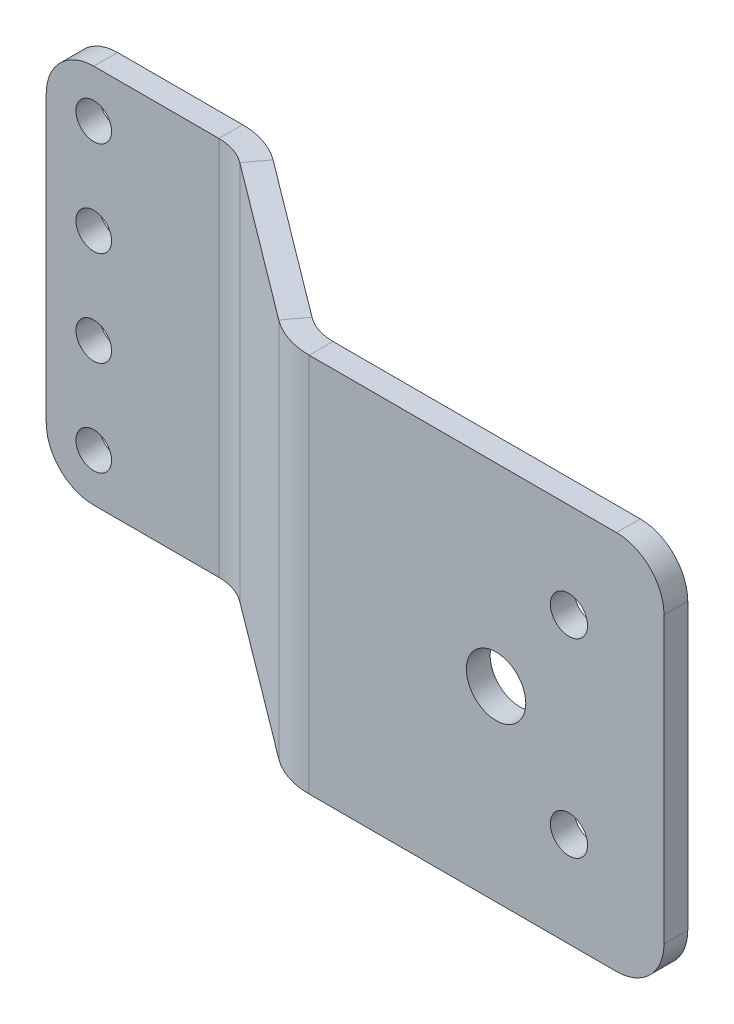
ISO-10303-21;
HEADER;
FILE_DESCRIPTION(('STEP AP214'),'2;1');
FILE_NAME('part.step','',(''),(''),'','','');
FILE_SCHEMA(('AUTOMOTIVE_DESIGN { 1 0 10303 214 1 1 1 1 }'));
ENDSEC;
DATA;
#1=APPLICATION_CONTEXT('core data for automotive mechanical design processes');
#2=APPLICATION_PROTOCOL_DEFINITION('international standard','automotive_design',2000,#1);
#3=PRODUCT_CONTEXT('',#1,'mechanical');
#4=PRODUCT('Part','Part','',(#3));
#5=PRODUCT_RELATED_PRODUCT_CATEGORY('part','',(#4));
#6=PRODUCT_DEFINITION_FORMATION('','',#4);
#7=PRODUCT_DEFINITION_CONTEXT('part definition',#1,'design');
#8=PRODUCT_DEFINITION('design','',#6,#7);
#9=PRODUCT_DEFINITION_SHAPE('','',#8);
#10=(LENGTH_UNIT() NAMED_UNIT(*) SI_UNIT(.MILLI.,.METRE.));
#11=(NAMED_UNIT(*) PLANE_ANGLE_UNIT() SI_UNIT($,.RADIAN.));
#12=(NAMED_UNIT(*) SI_UNIT($,.STERADIAN.) SOLID_ANGLE_UNIT());
#13=UNCERTAINTY_MEASURE_WITH_UNIT(LENGTH_MEASURE(1.E-05),#10,'distance_accuracy_value','');
#14=(GEOMETRIC_REPRESENTATION_CONTEXT(3) GLOBAL_UNCERTAINTY_ASSIGNED_CONTEXT((#13)) GLOBAL_UNIT_ASSIGNED_CONTEXT((#10,
#11,#12)) REPRESENTATION_CONTEXT('',''));
#15=CARTESIAN_POINT('',(0.,0.,0.));
#16=DIRECTION('',(0.,0.,1.));
#17=DIRECTION('',(1.,0.,0.));
#18=AXIS2_PLACEMENT_3D('',#15,#16,#17);
#19=CARTESIAN_POINT('',(-28.1133333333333,50.8,17.015));
#20=DIRECTION('',(0.,1.,0.));
#21=DIRECTION('',(0.,0.,1.));
#22=AXIS2_PLACEMENT_3D('',#19,#20,#21);
#23=PLANE('',#22);
#24=DIRECTION('',(0.6,0.,-0.8));
#25=VECTOR('',#24,1.);
#26=CARTESIAN_POINT('',(-28.1133333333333,50.8,17.015));
#27=LINE('',#26,#25);
#28=CARTESIAN_POINT('',(-28.1133333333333,50.8,17.015));
#29=VERTEX_POINT('',#28);
#30=CARTESIAN_POINT('',(-26.2083333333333,50.8,14.475));
#31=VERTEX_POINT('',#30);
#32=EDGE_CURVE('E271',#29,#31,#27,.T.);
#33=ORIENTED_EDGE('',*,*,#32,.F.);
#34=CARTESIAN_POINT('',(-22.0083333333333,50.8,8.875));
#35=DIRECTION('',(0.,1.,0.));
#36=DIRECTION('',(0.,0.,1.));
#37=AXIS2_PLACEMENT_3D('',#34,#35,#36);
#38=CIRCLE('',#37,10.175);
#39=CARTESIAN_POINT('',(-22.0083333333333,50.8,19.05));
#40=VERTEX_POINT('',#39);
#41=EDGE_CURVE('E188',#40,#29,#38,.F.);
#42=ORIENTED_EDGE('',*,*,#41,.F.);
#43=DIRECTION('',(0.,0.,1.));
#44=VECTOR('',#43,1.);
#45=CARTESIAN_POINT('',(-22.0083333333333,50.8,15.875));
#46=LINE('',#45,#44);
#47=CARTESIAN_POINT('',(-22.0083333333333,50.8,15.875));
#48=VERTEX_POINT('',#47);
#49=EDGE_CURVE('E268',#48,#40,#46,.T.);
#50=ORIENTED_EDGE('',*,*,#49,.F.);
#51=CARTESIAN_POINT('',(-22.0083333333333,50.8,8.875));
#52=DIRECTION('',(0.,1.,0.));
#53=DIRECTION('',(1.,0.,0.));
#54=AXIS2_PLACEMENT_3D('',#51,#52,#53);
#55=CIRCLE('',#54,7.);
#56=EDGE_CURVE('E198',#48,#31,#55,.F.);
#57=ORIENTED_EDGE('',*,*,#56,.T.);
#58=EDGE_LOOP('',(#33,#42,#50,#57));
#59=FACE_BOUND('',#58,.T.);
#60=ADVANCED_FACE('F38',(#59),#23,.T.);
#61=CARTESIAN_POINT('',(-22.0083333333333,50.8,15.875));
#62=DIRECTION('',(0.,1.,0.));
#63=DIRECTION('',(0.,0.,1.));
#64=AXIS2_PLACEMENT_3D('',#61,#62,#63);
#65=PLANE('',#64);
#66=DIRECTION('',(-0.8,0.,-0.6));
#67=VECTOR('',#66,1.);
#68=CARTESIAN_POINT('',(-25.4,50.8,19.05));
#69=LINE('',#68,#67);
#70=CARTESIAN_POINT('',(-48.9333333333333,50.8,1.39999999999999));
#71=VERTEX_POINT('',#70);
#72=EDGE_CURVE('E186',#29,#71,#69,.T.);
#73=ORIENTED_EDGE('',*,*,#72,.F.);
#74=ORIENTED_EDGE('',*,*,#32,.T.);
#75=DIRECTION('',(-0.8,0.,-0.6));
#76=VECTOR('',#75,1.);
#77=CARTESIAN_POINT('',(-23.495,50.8,16.51));
#78=LINE('',#77,#76);
#79=CARTESIAN_POINT('',(-47.0283333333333,50.8,-1.14000000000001));
#80=VERTEX_POINT('',#79);
#81=EDGE_CURVE('E201',#31,#80,#78,.T.);
#82=ORIENTED_EDGE('',*,*,#81,.T.);
#83=DIRECTION('',(-0.6,0.,0.8));
#84=VECTOR('',#83,1.);
#85=CARTESIAN_POINT('',(-47.0283333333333,50.8,-1.14000000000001));
#86=LINE('',#85,#84);
#87=EDGE_CURVE('E163',#80,#71,#86,.T.);
#88=ORIENTED_EDGE('',*,*,#87,.T.);
#89=EDGE_LOOP('',(#73,#74,#82,#88));
#90=FACE_BOUND('',#89,.T.);
#91=ADVANCED_FACE('F413',(#90),#65,.T.);
#92=CARTESIAN_POINT('',(-22.0083333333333,0.,19.05));
#93=DIRECTION('',(0.,-1.,0.));
#94=DIRECTION('',(0.,0.,-1.));
#95=AXIS2_PLACEMENT_3D('',#92,#93,#94);
#96=PLANE('',#95);
#97=DIRECTION('',(0.,0.,-1.));
#98=VECTOR('',#97,1.);
#99=CARTESIAN_POINT('',(-22.0083333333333,0.,19.05));
#100=LINE('',#99,#98);
#101=CARTESIAN_POINT('',(-22.0083333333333,0.,19.05));
#102=VERTEX_POINT('',#101);
#103=CARTESIAN_POINT('',(-22.0083333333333,0.,15.875));
#104=VERTEX_POINT('',#103);
#105=EDGE_CURVE('E265',#102,#104,#100,.T.);
#106=ORIENTED_EDGE('',*,*,#105,.F.);
#107=CARTESIAN_POINT('',(-22.0083333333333,0.,8.875));
#108=DIRECTION('',(0.,1.,0.));
#109=DIRECTION('',(0.,0.,1.));
#110=AXIS2_PLACEMENT_3D('',#107,#108,#109);
#111=CIRCLE('',#110,10.175);
#112=CARTESIAN_POINT('',(-28.1133333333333,0.,17.015));
#113=VERTEX_POINT('',#112);
#114=EDGE_CURVE('E216',#102,#113,#111,.F.);
#115=ORIENTED_EDGE('',*,*,#114,.T.);
#116=DIRECTION('',(-0.6,0.,0.8));
#117=VECTOR('',#116,1.);
#118=CARTESIAN_POINT('',(-26.2083333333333,0.,14.475));
#119=LINE('',#118,#117);
#120=CARTESIAN_POINT('',(-26.2083333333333,0.,14.475));
#121=VERTEX_POINT('',#120);
#122=EDGE_CURVE('E162',#121,#113,#119,.T.);
#123=ORIENTED_EDGE('',*,*,#122,.F.);
#124=CARTESIAN_POINT('',(-22.0083333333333,0.,8.875));
#125=DIRECTION('',(0.,1.,0.));
#126=DIRECTION('',(1.,0.,0.));
#127=AXIS2_PLACEMENT_3D('',#124,#125,#126);
#128=CIRCLE('',#127,7.);
#129=EDGE_CURVE('E223',#104,#121,#128,.F.);
#130=ORIENTED_EDGE('',*,*,#129,.F.);
#131=EDGE_LOOP('',(#106,#115,#123,#130));
#132=FACE_BOUND('',#131,.T.);
#133=ADVANCED_FACE('F391',(#132),#96,.T.);
#134=CARTESIAN_POINT('',(-26.2083333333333,0.,14.475));
#135=DIRECTION('',(0.,-1.,0.));
#136=DIRECTION('',(0.,0.,-1.));
#137=AXIS2_PLACEMENT_3D('',#134,#135,#136);
#138=PLANE('',#137);
#139=DIRECTION('',(-1.,0.,0.));
#140=VECTOR('',#139,1.);
#141=CARTESIAN_POINT('',(25.4,0.,15.875));
#142=LINE('',#141,#140);
#143=CARTESIAN_POINT('',(19.05,0.,15.875));
#144=VERTEX_POINT('',#143);
#145=EDGE_CURVE('E221',#144,#104,#142,.T.);
#146=ORIENTED_EDGE('',*,*,#145,.F.);
#147=DIRECTION('',(0.,0.,1.));
#148=VECTOR('',#147,1.);
#149=CARTESIAN_POINT('',(19.05,0.,14.475));
#150=LINE('',#149,#148);
#151=CARTESIAN_POINT('',(19.05,0.,19.05));
#152=VERTEX_POINT('',#151);
#153=EDGE_CURVE('E273',#144,#152,#150,.T.);
#154=ORIENTED_EDGE('',*,*,#153,.T.);
#155=DIRECTION('',(-1.,0.,0.));
#156=VECTOR('',#155,1.);
#157=CARTESIAN_POINT('',(25.4,0.,19.05));
#158=LINE('',#157,#156);
#159=EDGE_CURVE('E219',#152,#102,#158,.T.);
#160=ORIENTED_EDGE('',*,*,#159,.T.);
#161=ORIENTED_EDGE('',*,*,#105,.T.);
#162=EDGE_LOOP('',(#146,#154,#160,#161));
#163=FACE_BOUND('',#162,.T.);
#164=ADVANCED_FACE('F387',(#163),#138,.T.);
#165=CARTESIAN_POINT('',(-53.1333333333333,50.8,0.));
#166=DIRECTION('',(0.,1.,0.));
#167=DIRECTION('',(0.,0.,1.));
#168=AXIS2_PLACEMENT_3D('',#165,#166,#167);
#169=PLANE('',#168);
#170=DIRECTION('',(0.,0.,-1.));
#171=VECTOR('',#170,1.);
#172=CARTESIAN_POINT('',(-53.1333333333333,50.8,0.));
#173=LINE('',#172,#171);
#174=CARTESIAN_POINT('',(-53.1333333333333,50.8,0.));
#175=VERTEX_POINT('',#174);
#176=CARTESIAN_POINT('',(-53.1333333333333,50.8,-3.17500000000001));
#177=VERTEX_POINT('',#176);
#178=EDGE_CURVE('E153',#175,#177,#173,.T.);
#179=ORIENTED_EDGE('',*,*,#178,.F.);
#180=CARTESIAN_POINT('',(-53.1333333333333,50.8,6.99999999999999));
#181=DIRECTION('',(0.,-1.,0.));
#182=DIRECTION('',(0.,0.,-1.));
#183=AXIS2_PLACEMENT_3D('',#180,#181,#182);
#184=CIRCLE('',#183,7.);
#185=EDGE_CURVE('E157',#71,#175,#184,.F.);
#186=ORIENTED_EDGE('',*,*,#185,.F.);
#187=ORIENTED_EDGE('',*,*,#87,.F.);
#188=CARTESIAN_POINT('',(-53.1333333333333,50.8,6.99999999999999));
#189=DIRECTION('',(0.,1.,0.));
#190=DIRECTION('',(1.,0.,0.));
#191=AXIS2_PLACEMENT_3D('',#188,#189,#190);
#192=CIRCLE('',#191,10.175);
#193=EDGE_CURVE('E160',#80,#177,#192,.T.);
#194=ORIENTED_EDGE('',*,*,#193,.T.);
#195=EDGE_LOOP('',(#179,#186,#187,#194));
#196=FACE_BOUND('',#195,.T.);
#197=ADVANCED_FACE('F155',(#196),#169,.T.);
#198=CARTESIAN_POINT('',(-47.0283333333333,50.8,-1.14000000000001));
#199=DIRECTION('',(0.,1.,0.));
#200=DIRECTION('',(0.,0.,1.));
#201=AXIS2_PLACEMENT_3D('',#198,#199,#200);
#202=PLANE('',#201);
#203=DIRECTION('',(-1.,0.,0.));
#204=VECTOR('',#203,1.);
#205=CARTESIAN_POINT('',(-50.8,50.8,-3.17500000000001));
#206=LINE('',#205,#204);
#207=CARTESIAN_POINT('',(-69.85,50.8,-3.175));
#208=VERTEX_POINT('',#207);
#209=EDGE_CURVE('E181',#177,#208,#206,.T.);
#210=ORIENTED_EDGE('',*,*,#209,.T.);
#211=DIRECTION('',(0.,0.,-1.));
#212=VECTOR('',#211,1.);
#213=CARTESIAN_POINT('',(-69.85,50.8,-1.14000000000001));
#214=LINE('',#213,#212);
#215=CARTESIAN_POINT('',(-69.85,50.8,0.));
#216=VERTEX_POINT('',#215);
#217=EDGE_CURVE('E11',#208,#216,#214,.F.);
#218=ORIENTED_EDGE('',*,*,#217,.T.);
#219=DIRECTION('',(-1.,0.,0.));
#220=VECTOR('',#219,1.);
#221=CARTESIAN_POINT('',(-50.8,50.8,0.));
#222=LINE('',#221,#220);
#223=EDGE_CURVE('E170',#175,#216,#222,.T.);
#224=ORIENTED_EDGE('',*,*,#223,.F.);
#225=ORIENTED_EDGE('',*,*,#178,.T.);
#226=EDGE_LOOP('',(#210,#218,#224,#225));
#227=FACE_BOUND('',#226,.T.);
#228=ADVANCED_FACE('F180',(#227),#202,.T.);
#229=CARTESIAN_POINT('',(-48.9333333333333,0.,1.39999999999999));
#230=DIRECTION('',(0.,-1.,0.));
#231=DIRECTION('',(0.,0.,-1.));
#232=AXIS2_PLACEMENT_3D('',#229,#230,#231);
#233=PLANE('',#232);
#234=DIRECTION('',(0.6,0.,-0.8));
#235=VECTOR('',#234,1.);
#236=CARTESIAN_POINT('',(-48.9333333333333,0.,1.39999999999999));
#237=LINE('',#236,#235);
#238=CARTESIAN_POINT('',(-48.9333333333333,0.,1.39999999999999));
#239=VERTEX_POINT('',#238);
#240=CARTESIAN_POINT('',(-47.0283333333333,0.,-1.14000000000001));
#241=VERTEX_POINT('',#240);
#242=EDGE_CURVE('E261',#239,#241,#237,.T.);
#243=ORIENTED_EDGE('',*,*,#242,.F.);
#244=CARTESIAN_POINT('',(-53.1333333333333,0.,6.99999999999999));
#245=DIRECTION('',(0.,-1.,0.));
#246=DIRECTION('',(0.,0.,-1.));
#247=AXIS2_PLACEMENT_3D('',#244,#245,#246);
#248=CIRCLE('',#247,7.);
#249=CARTESIAN_POINT('',(-53.1333333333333,0.,0.));
#250=VERTEX_POINT('',#249);
#251=EDGE_CURVE('E211',#239,#250,#248,.F.);
#252=ORIENTED_EDGE('',*,*,#251,.T.);
#253=DIRECTION('',(0.,0.,1.));
#254=VECTOR('',#253,1.);
#255=CARTESIAN_POINT('',(-53.1333333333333,0.,-3.17500000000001));
#256=LINE('',#255,#254);
#257=CARTESIAN_POINT('',(-53.1333333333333,0.,-3.17500000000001));
#258=VERTEX_POINT('',#257);
#259=EDGE_CURVE('E259',#258,#250,#256,.T.);
#260=ORIENTED_EDGE('',*,*,#259,.F.);
#261=CARTESIAN_POINT('',(-53.1333333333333,0.,6.99999999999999));
#262=DIRECTION('',(0.,1.,0.));
#263=DIRECTION('',(1.,0.,0.));
#264=AXIS2_PLACEMENT_3D('',#261,#262,#263);
#265=CIRCLE('',#264,10.175);
#266=EDGE_CURVE('E229',#241,#258,#265,.T.);
#267=ORIENTED_EDGE('',*,*,#266,.F.);
#268=EDGE_LOOP('',(#243,#252,#260,#267));
#269=FACE_BOUND('',#268,.T.);
#270=ADVANCED_FACE('F407',(#269),#233,.T.);
#271=CARTESIAN_POINT('',(-53.1333333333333,0.,-3.17500000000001));
#272=DIRECTION('',(0.,-1.,0.));
#273=DIRECTION('',(0.,0.,-1.));
#274=AXIS2_PLACEMENT_3D('',#271,#272,#273);
#275=PLANE('',#274);
#276=DIRECTION('',(-0.8,0.,-0.6));
#277=VECTOR('',#276,1.);
#278=CARTESIAN_POINT('',(-25.4,0.,19.05));
#279=LINE('',#278,#277);
#280=EDGE_CURVE('E213',#113,#239,#279,.T.);
#281=ORIENTED_EDGE('',*,*,#280,.T.);
#282=ORIENTED_EDGE('',*,*,#242,.T.);
#283=DIRECTION('',(-0.8,0.,-0.6));
#284=VECTOR('',#283,1.);
#285=CARTESIAN_POINT('',(-23.495,0.,16.51));
#286=LINE('',#285,#284);
#287=EDGE_CURVE('E226',#121,#241,#286,.T.);
#288=ORIENTED_EDGE('',*,*,#287,.F.);
#289=ORIENTED_EDGE('',*,*,#122,.T.);
#290=EDGE_LOOP('',(#281,#282,#288,#289));
#291=FACE_BOUND('',#290,.T.);
#292=ADVANCED_FACE('F403',(#291),#275,.T.);
#293=CARTESIAN_POINT('',(-50.8,50.8,-3.17500000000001));
#294=DIRECTION('',(0.,0.,1.));
#295=DIRECTION('',(1.,0.,0.));
#296=AXIS2_PLACEMENT_3D('',#293,#294,#295);
#297=PLANE('',#296);
#298=CARTESIAN_POINT('',(-69.85,6.35,-3.175));
#299=DIRECTION('',(0.,0.,1.));
#300=DIRECTION('',(1.,0.,0.));
#301=AXIS2_PLACEMENT_3D('',#298,#299,#300);
#302=CIRCLE('',#301,2.38125000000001);
#303=CARTESIAN_POINT('',(-67.46875,6.35,-3.175));
#304=VERTEX_POINT('',#303);
#305=EDGE_CURVE('E333',#304,#304,#302,.T.);
#306=ORIENTED_EDGE('',*,*,#305,.T.);
#307=EDGE_LOOP('',(#306));
#308=FACE_BOUND('',#307,.T.);
#309=CARTESIAN_POINT('',(-69.85,19.05,-3.175));
#310=DIRECTION('',(0.,0.,1.));
#311=DIRECTION('',(1.,0.,0.));
#312=AXIS2_PLACEMENT_3D('',#309,#310,#311);
#313=CIRCLE('',#312,2.38125000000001);
#314=CARTESIAN_POINT('',(-67.46875,19.05,-3.175));
#315=VERTEX_POINT('',#314);
#316=EDGE_CURVE('E327',#315,#315,#313,.T.);
#317=ORIENTED_EDGE('',*,*,#316,.T.);
#318=EDGE_LOOP('',(#317));
#319=FACE_BOUND('',#318,.T.);
#320=CARTESIAN_POINT('',(-69.85,31.75,-3.175));
#321=DIRECTION('',(0.,0.,1.));
#322=DIRECTION('',(1.,0.,0.));
#323=AXIS2_PLACEMENT_3D('',#320,#321,#322);
#324=CIRCLE('',#323,2.38125);
#325=CARTESIAN_POINT('',(-67.46875,31.75,-3.175));
#326=VERTEX_POINT('',#325);
#327=EDGE_CURVE('E321',#326,#326,#324,.T.);
#328=ORIENTED_EDGE('',*,*,#327,.T.);
#329=EDGE_LOOP('',(#328));
#330=FACE_BOUND('',#329,.T.);
#331=CARTESIAN_POINT('',(-69.85,44.45,-3.175));
#332=DIRECTION('',(0.,0.,1.));
#333=DIRECTION('',(1.,0.,0.));
#334=AXIS2_PLACEMENT_3D('',#331,#332,#333);
#335=CIRCLE('',#334,2.38125);
#336=CARTESIAN_POINT('',(-67.46875,44.45,-3.175));
#337=VERTEX_POINT('',#336);
#338=EDGE_CURVE('E209',#337,#337,#335,.T.);
#339=ORIENTED_EDGE('',*,*,#338,.T.);
#340=EDGE_LOOP('',(#339));
#341=FACE_BOUND('',#340,.T.);
#342=DIRECTION('',(-1.,0.,0.));
#343=VECTOR('',#342,1.);
#344=CARTESIAN_POINT('',(-50.8,0.,-3.17500000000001));
#345=LINE('',#344,#343);
#346=CARTESIAN_POINT('',(-69.85,0.,-3.175));
#347=VERTEX_POINT('',#346);
#348=EDGE_CURVE('E206',#258,#347,#345,.T.);
#349=ORIENTED_EDGE('',*,*,#348,.T.);
#350=CARTESIAN_POINT('',(-69.85,6.35,-3.175));
#351=DIRECTION('',(0.,0.,1.));
#352=DIRECTION('',(1.,0.,0.));
#353=AXIS2_PLACEMENT_3D('',#350,#351,#352);
#354=CIRCLE('',#353,6.35);
#355=CARTESIAN_POINT('',(-76.2,6.35,-3.175));
#356=VERTEX_POINT('',#355);
#357=EDGE_CURVE('E296',#347,#356,#354,.F.);
#358=ORIENTED_EDGE('',*,*,#357,.T.);
#359=DIRECTION('',(0.,-1.,0.));
#360=VECTOR('',#359,1.);
#361=CARTESIAN_POINT('',(-76.2,50.8,-3.175));
#362=LINE('',#361,#360);
#363=CARTESIAN_POINT('',(-76.2,44.45,-3.175));
#364=VERTEX_POINT('',#363);
#365=EDGE_CURVE('E257',#364,#356,#362,.T.);
#366=ORIENTED_EDGE('',*,*,#365,.F.);
#367=CARTESIAN_POINT('',(-69.85,44.45,-3.175));
#368=DIRECTION('',(0.,0.,1.));
#369=DIRECTION('',(1.,0.,0.));
#370=AXIS2_PLACEMENT_3D('',#367,#368,#369);
#371=CIRCLE('',#370,6.35);
#372=EDGE_CURVE('E294',#364,#208,#371,.F.);
#373=ORIENTED_EDGE('',*,*,#372,.T.);
#374=ORIENTED_EDGE('',*,*,#209,.F.);
#375=DIRECTION('',(0.,-1.,0.));
#376=VECTOR('',#375,1.);
#377=CARTESIAN_POINT('',(-53.1333333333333,50.8,-3.17500000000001));
#378=LINE('',#377,#376);
#379=EDGE_CURVE('E205',#177,#258,#378,.T.);
#380=ORIENTED_EDGE('',*,*,#379,.T.);
#381=EDGE_LOOP('',(#349,#358,#366,#373,#374,#380));
#382=FACE_BOUND('',#381,.T.);
#383=ADVANCED_FACE('F312',(#308,#319,#330,#341,#382),#297,.F.);
#384=CARTESIAN_POINT('',(-76.2,50.8,0.));
#385=DIRECTION('',(-1.,0.,0.));
#386=DIRECTION('',(0.,0.,1.));
#387=AXIS2_PLACEMENT_3D('',#384,#385,#386);
#388=PLANE('',#387);
#389=ORIENTED_EDGE('',*,*,#365,.T.);
#390=DIRECTION('',(0.,0.,-1.));
#391=VECTOR('',#390,1.);
#392=CARTESIAN_POINT('',(-76.2,6.35,0.));
#393=LINE('',#392,#391);
#394=CARTESIAN_POINT('',(-76.2,6.35,0.));
#395=VERTEX_POINT('',#394);
#396=EDGE_CURVE('E59',#356,#395,#393,.F.);
#397=ORIENTED_EDGE('',*,*,#396,.T.);
#398=DIRECTION('',(0.,-1.,0.));
#399=VECTOR('',#398,1.);
#400=CARTESIAN_POINT('',(-76.2,50.8,0.));
#401=LINE('',#400,#399);
#402=CARTESIAN_POINT('',(-76.2,44.45,0.));
#403=VERTEX_POINT('',#402);
#404=EDGE_CURVE('E177',#403,#395,#401,.T.);
#405=ORIENTED_EDGE('',*,*,#404,.F.);
#406=DIRECTION('',(0.,0.,-1.));
#407=VECTOR('',#406,1.);
#408=CARTESIAN_POINT('',(-76.2,44.45,0.));
#409=LINE('',#408,#407);
#410=EDGE_CURVE('E298',#403,#364,#409,.T.);
#411=ORIENTED_EDGE('',*,*,#410,.T.);
#412=EDGE_LOOP('',(#389,#397,#405,#411));
#413=FACE_BOUND('',#412,.T.);
#414=ADVANCED_FACE('F313',(#413),#388,.T.);
#415=CARTESIAN_POINT('',(-50.8,50.8,0.));
#416=DIRECTION('',(0.,0.,1.));
#417=DIRECTION('',(1.,0.,0.));
#418=AXIS2_PLACEMENT_3D('',#415,#416,#417);
#419=PLANE('',#418);
#420=CARTESIAN_POINT('',(-69.85,6.35,0.));
#421=DIRECTION('',(0.,0.,1.));
#422=DIRECTION('',(1.,0.,0.));
#423=AXIS2_PLACEMENT_3D('',#420,#421,#422);
#424=CIRCLE('',#423,2.38125000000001);
#425=CARTESIAN_POINT('',(-67.46875,6.35,0.));
#426=VERTEX_POINT('',#425);
#427=EDGE_CURVE('E336',#426,#426,#424,.T.);
#428=ORIENTED_EDGE('',*,*,#427,.F.);
#429=EDGE_LOOP('',(#428));
#430=FACE_BOUND('',#429,.T.);
#431=CARTESIAN_POINT('',(-69.85,19.05,0.));
#432=DIRECTION('',(0.,0.,1.));
#433=DIRECTION('',(1.,0.,0.));
#434=AXIS2_PLACEMENT_3D('',#431,#432,#433);
#435=CIRCLE('',#434,2.38125000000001);
#436=CARTESIAN_POINT('',(-67.46875,19.05,0.));
#437=VERTEX_POINT('',#436);
#438=EDGE_CURVE('E330',#437,#437,#435,.T.);
#439=ORIENTED_EDGE('',*,*,#438,.F.);
#440=EDGE_LOOP('',(#439));
#441=FACE_BOUND('',#440,.T.);
#442=CARTESIAN_POINT('',(-69.85,31.75,0.));
#443=DIRECTION('',(0.,0.,1.));
#444=DIRECTION('',(1.,0.,0.));
#445=AXIS2_PLACEMENT_3D('',#442,#443,#444);
#446=CIRCLE('',#445,2.38125);
#447=CARTESIAN_POINT('',(-67.46875,31.75,0.));
#448=VERTEX_POINT('',#447);
#449=EDGE_CURVE('E324',#448,#448,#446,.T.);
#450=ORIENTED_EDGE('',*,*,#449,.F.);
#451=EDGE_LOOP('',(#450));
#452=FACE_BOUND('',#451,.T.);
#453=CARTESIAN_POINT('',(-69.85,44.45,0.));
#454=DIRECTION('',(0.,0.,1.));
#455=DIRECTION('',(1.,0.,0.));
#456=AXIS2_PLACEMENT_3D('',#453,#454,#455);
#457=CIRCLE('',#456,2.38125);
#458=CARTESIAN_POINT('',(-67.46875,44.45,0.));
#459=VERTEX_POINT('',#458);
#460=EDGE_CURVE('E318',#459,#459,#457,.T.);
#461=ORIENTED_EDGE('',*,*,#460,.F.);
#462=EDGE_LOOP('',(#461));
#463=FACE_BOUND('',#462,.T.);
#464=ORIENTED_EDGE('',*,*,#404,.T.);
#465=CARTESIAN_POINT('',(-69.85,6.35,0.));
#466=DIRECTION('',(0.,0.,1.));
#467=DIRECTION('',(1.,0.,0.));
#468=AXIS2_PLACEMENT_3D('',#465,#466,#467);
#469=CIRCLE('',#468,6.35);
#470=CARTESIAN_POINT('',(-69.85,0.,0.));
#471=VERTEX_POINT('',#470);
#472=EDGE_CURVE('E46',#395,#471,#469,.T.);
#473=ORIENTED_EDGE('',*,*,#472,.T.);
#474=DIRECTION('',(-1.,0.,0.));
#475=VECTOR('',#474,1.);
#476=CARTESIAN_POINT('',(-50.8,0.,0.));
#477=LINE('',#476,#475);
#478=EDGE_CURVE('E173',#250,#471,#477,.T.);
#479=ORIENTED_EDGE('',*,*,#478,.F.);
#480=DIRECTION('',(0.,-1.,0.));
#481=VECTOR('',#480,1.);
#482=CARTESIAN_POINT('',(-53.1333333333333,50.8,0.));
#483=LINE('',#482,#481);
#484=EDGE_CURVE('E168',#175,#250,#483,.T.);
#485=ORIENTED_EDGE('',*,*,#484,.F.);
#486=ORIENTED_EDGE('',*,*,#223,.T.);
#487=CARTESIAN_POINT('',(-69.85,44.45,0.));
#488=DIRECTION('',(0.,0.,1.));
#489=DIRECTION('',(1.,0.,0.));
#490=AXIS2_PLACEMENT_3D('',#487,#488,#489);
#491=CIRCLE('',#490,6.35);
#492=EDGE_CURVE('E302',#216,#403,#491,.T.);
#493=ORIENTED_EDGE('',*,*,#492,.T.);
#494=EDGE_LOOP('',(#464,#473,#479,#485,#486,#493));
#495=FACE_BOUND('',#494,.T.);
#496=ADVANCED_FACE('F169',(#430,#441,#452,#463,#495),#419,.T.);
#497=CARTESIAN_POINT('',(-53.1333333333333,50.8,6.99999999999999));
#498=DIRECTION('',(0.,-1.,0.));
#499=DIRECTION('',(0.,0.,-1.));
#500=AXIS2_PLACEMENT_3D('',#497,#498,#499);
#501=CYLINDRICAL_SURFACE('',#500,7.);
#502=ORIENTED_EDGE('',*,*,#251,.F.);
#503=DIRECTION('',(0.,-1.,0.));
#504=VECTOR('',#503,1.);
#505=CARTESIAN_POINT('',(-48.9333333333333,50.8,1.39999999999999));
#506=LINE('',#505,#504);
#507=EDGE_CURVE('E178',#71,#239,#506,.T.);
#508=ORIENTED_EDGE('',*,*,#507,.F.);
#509=ORIENTED_EDGE('',*,*,#185,.T.);
#510=ORIENTED_EDGE('',*,*,#484,.T.);
#511=EDGE_LOOP('',(#502,#508,#509,#510));
#512=FACE_BOUND('',#511,.T.);
#513=ADVANCED_FACE('F184',(#512),#501,.F.);
#514=CARTESIAN_POINT('',(-25.4,50.8,19.05));
#515=DIRECTION('',(-0.6,0.,0.8));
#516=DIRECTION('',(0.8,0.,0.6));
#517=AXIS2_PLACEMENT_3D('',#514,#515,#516);
#518=PLANE('',#517);
#519=ORIENTED_EDGE('',*,*,#280,.F.);
#520=DIRECTION('',(0.,-1.,0.));
#521=VECTOR('',#520,1.);
#522=CARTESIAN_POINT('',(-28.1133333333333,50.8,17.015));
#523=LINE('',#522,#521);
#524=EDGE_CURVE('E252',#29,#113,#523,.T.);
#525=ORIENTED_EDGE('',*,*,#524,.F.);
#526=ORIENTED_EDGE('',*,*,#72,.T.);
#527=ORIENTED_EDGE('',*,*,#507,.T.);
#528=EDGE_LOOP('',(#519,#525,#526,#527));
#529=FACE_BOUND('',#528,.T.);
#530=ADVANCED_FACE('F409',(#529),#518,.T.);
#531=CARTESIAN_POINT('',(-22.0083333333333,50.8,8.875));
#532=DIRECTION('',(0.,-1.,0.));
#533=DIRECTION('',(0.,0.,-1.));
#534=AXIS2_PLACEMENT_3D('',#531,#532,#533);
#535=CYLINDRICAL_SURFACE('',#534,10.175);
#536=ORIENTED_EDGE('',*,*,#114,.F.);
#537=DIRECTION('',(0.,-1.,0.));
#538=VECTOR('',#537,1.);
#539=CARTESIAN_POINT('',(-22.0083333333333,50.8,19.05));
#540=LINE('',#539,#538);
#541=EDGE_CURVE('E249',#40,#102,#540,.T.);
#542=ORIENTED_EDGE('',*,*,#541,.F.);
#543=ORIENTED_EDGE('',*,*,#41,.T.);
#544=ORIENTED_EDGE('',*,*,#524,.T.);
#545=EDGE_LOOP('',(#536,#542,#543,#544));
#546=FACE_BOUND('',#545,.T.);
#547=ADVANCED_FACE('F374',(#546),#535,.T.);
#548=CARTESIAN_POINT('',(25.4,50.8,19.05));
#549=DIRECTION('',(0.,0.,1.));
#550=DIRECTION('',(1.,0.,0.));
#551=AXIS2_PLACEMENT_3D('',#548,#549,#550);
#552=PLANE('',#551);
#553=CARTESIAN_POINT('',(12.7,12.7,19.05));
#554=DIRECTION('',(0.,0.,1.));
#555=DIRECTION('',(1.,0.,0.));
#556=AXIS2_PLACEMENT_3D('',#553,#554,#555);
#557=CIRCLE('',#556,2.4892);
#558=CARTESIAN_POINT('',(15.1892,12.7,19.05));
#559=VERTEX_POINT('',#558);
#560=EDGE_CURVE('E354',#559,#559,#557,.T.);
#561=ORIENTED_EDGE('',*,*,#560,.F.);
#562=EDGE_LOOP('',(#561));
#563=FACE_BOUND('',#562,.T.);
#564=CARTESIAN_POINT('',(12.7,38.1,19.05));
#565=DIRECTION('',(0.,0.,1.));
#566=DIRECTION('',(1.,0.,0.));
#567=AXIS2_PLACEMENT_3D('',#564,#565,#566);
#568=CIRCLE('',#567,2.4892);
#569=CARTESIAN_POINT('',(15.1892,38.1,19.05));
#570=VERTEX_POINT('',#569);
#571=EDGE_CURVE('E348',#570,#570,#568,.T.);
#572=ORIENTED_EDGE('',*,*,#571,.F.);
#573=EDGE_LOOP('',(#572));
#574=FACE_BOUND('',#573,.T.);
#575=CARTESIAN_POINT('',(2.96051180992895,24.9688451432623,19.05));
#576=DIRECTION('',(0.,0.,1.));
#577=DIRECTION('',(1.,0.,0.));
#578=AXIS2_PLACEMENT_3D('',#575,#576,#577);
#579=CIRCLE('',#578,3.96875);
#580=CARTESIAN_POINT('',(6.92926180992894,24.9688451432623,19.05));
#581=VERTEX_POINT('',#580);
#582=EDGE_CURVE('E342',#581,#581,#579,.T.);
#583=ORIENTED_EDGE('',*,*,#582,.F.);
#584=EDGE_LOOP('',(#583));
#585=FACE_BOUND('',#584,.T.);
#586=ORIENTED_EDGE('',*,*,#159,.F.);
#587=CARTESIAN_POINT('',(19.05,6.35,19.05));
#588=DIRECTION('',(0.,0.,1.));
#589=DIRECTION('',(1.,0.,0.));
#590=AXIS2_PLACEMENT_3D('',#587,#588,#589);
#591=CIRCLE('',#590,6.35);
#592=CARTESIAN_POINT('',(25.4,6.35,19.05));
#593=VERTEX_POINT('',#592);
#594=EDGE_CURVE('E278',#152,#593,#591,.T.);
#595=ORIENTED_EDGE('',*,*,#594,.T.);
#596=DIRECTION('',(0.,-1.,0.));
#597=VECTOR('',#596,1.);
#598=CARTESIAN_POINT('',(25.4,50.8,19.05));
#599=LINE('',#598,#597);
#600=CARTESIAN_POINT('',(25.4,44.45,19.05));
#601=VERTEX_POINT('',#600);
#602=EDGE_CURVE('E246',#601,#593,#599,.T.);
#603=ORIENTED_EDGE('',*,*,#602,.F.);
#604=CARTESIAN_POINT('',(19.05,44.45,19.05));
#605=DIRECTION('',(0.,0.,1.));
#606=DIRECTION('',(1.,0.,0.));
#607=AXIS2_PLACEMENT_3D('',#604,#605,#606);
#608=CIRCLE('',#607,6.35);
#609=CARTESIAN_POINT('',(19.05,50.8,19.05));
#610=VERTEX_POINT('',#609);
#611=EDGE_CURVE('E276',#601,#610,#608,.T.);
#612=ORIENTED_EDGE('',*,*,#611,.T.);
#613=DIRECTION('',(-1.,0.,0.));
#614=VECTOR('',#613,1.);
#615=CARTESIAN_POINT('',(25.4,50.8,19.05));
#616=LINE('',#615,#614);
#617=EDGE_CURVE('E194',#610,#40,#616,.T.);
#618=ORIENTED_EDGE('',*,*,#617,.T.);
#619=ORIENTED_EDGE('',*,*,#541,.T.);
#620=EDGE_LOOP('',(#586,#595,#603,#612,#618,#619));
#621=FACE_BOUND('',#620,.T.);
#622=ADVANCED_FACE('F370',(#563,#574,#585,#621),#552,.T.);
#623=CARTESIAN_POINT('',(25.4,50.8,15.875));
#624=DIRECTION('',(1.,0.,0.));
#625=DIRECTION('',(0.,0.,-1.));
#626=AXIS2_PLACEMENT_3D('',#623,#624,#625);
#627=PLANE('',#626);
#628=ORIENTED_EDGE('',*,*,#602,.T.);
#629=DIRECTION('',(0.,0.,1.));
#630=VECTOR('',#629,1.);
#631=CARTESIAN_POINT('',(25.4,6.35,15.875));
#632=LINE('',#631,#630);
#633=CARTESIAN_POINT('',(25.4,6.35,15.875));
#634=VERTEX_POINT('',#633);
#635=EDGE_CURVE('E283',#593,#634,#632,.F.);
#636=ORIENTED_EDGE('',*,*,#635,.T.);
#637=DIRECTION('',(0.,-1.,0.));
#638=VECTOR('',#637,1.);
#639=CARTESIAN_POINT('',(25.4,50.8,15.875));
#640=LINE('',#639,#638);
#641=CARTESIAN_POINT('',(25.4,44.45,15.875));
#642=VERTEX_POINT('',#641);
#643=EDGE_CURVE('E243',#642,#634,#640,.T.);
#644=ORIENTED_EDGE('',*,*,#643,.F.);
#645=DIRECTION('',(0.,0.,1.));
#646=VECTOR('',#645,1.);
#647=CARTESIAN_POINT('',(25.4,44.45,19.05));
#648=LINE('',#647,#646);
#649=EDGE_CURVE('E280',#642,#601,#648,.T.);
#650=ORIENTED_EDGE('',*,*,#649,.T.);
#651=EDGE_LOOP('',(#628,#636,#644,#650));
#652=FACE_BOUND('',#651,.T.);
#653=ADVANCED_FACE('F373',(#652),#627,.T.);
#654=CARTESIAN_POINT('',(25.4,50.8,15.875));
#655=DIRECTION('',(0.,0.,1.));
#656=DIRECTION('',(1.,0.,0.));
#657=AXIS2_PLACEMENT_3D('',#654,#655,#656);
#658=PLANE('',#657);
#659=CARTESIAN_POINT('',(12.7,12.7,15.875));
#660=DIRECTION('',(0.,0.,1.));
#661=DIRECTION('',(1.,0.,0.));
#662=AXIS2_PLACEMENT_3D('',#659,#660,#661);
#663=CIRCLE('',#662,2.4892);
#664=CARTESIAN_POINT('',(15.1892,12.7,15.875));
#665=VERTEX_POINT('',#664);
#666=EDGE_CURVE('E351',#665,#665,#663,.T.);
#667=ORIENTED_EDGE('',*,*,#666,.T.);
#668=EDGE_LOOP('',(#667));
#669=FACE_BOUND('',#668,.T.);
#670=CARTESIAN_POINT('',(12.7,38.1,15.875));
#671=DIRECTION('',(0.,0.,1.));
#672=DIRECTION('',(1.,0.,0.));
#673=AXIS2_PLACEMENT_3D('',#670,#671,#672);
#674=CIRCLE('',#673,2.4892);
#675=CARTESIAN_POINT('',(15.1892,38.1,15.875));
#676=VERTEX_POINT('',#675);
#677=EDGE_CURVE('E345',#676,#676,#674,.T.);
#678=ORIENTED_EDGE('',*,*,#677,.T.);
#679=EDGE_LOOP('',(#678));
#680=FACE_BOUND('',#679,.T.);
#681=CARTESIAN_POINT('',(2.96051180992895,24.9688451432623,15.875));
#682=DIRECTION('',(0.,0.,1.));
#683=DIRECTION('',(1.,0.,0.));
#684=AXIS2_PLACEMENT_3D('',#681,#682,#683);
#685=CIRCLE('',#684,3.96875);
#686=CARTESIAN_POINT('',(6.92926180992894,24.9688451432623,15.875));
#687=VERTEX_POINT('',#686);
#688=EDGE_CURVE('E339',#687,#687,#685,.T.);
#689=ORIENTED_EDGE('',*,*,#688,.T.);
#690=EDGE_LOOP('',(#689));
#691=FACE_BOUND('',#690,.T.);
#692=ORIENTED_EDGE('',*,*,#643,.T.);
#693=CARTESIAN_POINT('',(19.05,6.35,15.875));
#694=DIRECTION('',(0.,0.,1.));
#695=DIRECTION('',(1.,0.,0.));
#696=AXIS2_PLACEMENT_3D('',#693,#694,#695);
#697=CIRCLE('',#696,6.35);
#698=EDGE_CURVE('E287',#634,#144,#697,.F.);
#699=ORIENTED_EDGE('',*,*,#698,.T.);
#700=ORIENTED_EDGE('',*,*,#145,.T.);
#701=DIRECTION('',(0.,-1.,0.));
#702=VECTOR('',#701,1.);
#703=CARTESIAN_POINT('',(-22.0083333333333,50.8,15.875));
#704=LINE('',#703,#702);
#705=EDGE_CURVE('E240',#48,#104,#704,.T.);
#706=ORIENTED_EDGE('',*,*,#705,.F.);
#707=DIRECTION('',(-1.,0.,0.));
#708=VECTOR('',#707,1.);
#709=CARTESIAN_POINT('',(25.4,50.8,15.875));
#710=LINE('',#709,#708);
#711=CARTESIAN_POINT('',(19.05,50.8,15.875));
#712=VERTEX_POINT('',#711);
#713=EDGE_CURVE('E196',#712,#48,#710,.T.);
#714=ORIENTED_EDGE('',*,*,#713,.F.);
#715=CARTESIAN_POINT('',(19.05,44.45,15.875));
#716=DIRECTION('',(0.,0.,1.));
#717=DIRECTION('',(1.,0.,0.));
#718=AXIS2_PLACEMENT_3D('',#715,#716,#717);
#719=CIRCLE('',#718,6.35);
#720=EDGE_CURVE('E285',#712,#642,#719,.F.);
#721=ORIENTED_EDGE('',*,*,#720,.T.);
#722=EDGE_LOOP('',(#692,#699,#700,#706,#714,#721));
#723=FACE_BOUND('',#722,.T.);
#724=ADVANCED_FACE('F360',(#669,#680,#691,#723),#658,.F.);
#725=CARTESIAN_POINT('',(-22.0083333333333,50.8,8.875));
#726=DIRECTION('',(0.,-1.,0.));
#727=DIRECTION('',(0.,0.,-1.));
#728=AXIS2_PLACEMENT_3D('',#725,#726,#727);
#729=CYLINDRICAL_SURFACE('',#728,7.);
#730=ORIENTED_EDGE('',*,*,#129,.T.);
#731=DIRECTION('',(0.,-1.,0.));
#732=VECTOR('',#731,1.);
#733=CARTESIAN_POINT('',(-26.2083333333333,50.8,14.475));
#734=LINE('',#733,#732);
#735=EDGE_CURVE('E237',#31,#121,#734,.T.);
#736=ORIENTED_EDGE('',*,*,#735,.F.);
#737=ORIENTED_EDGE('',*,*,#56,.F.);
#738=ORIENTED_EDGE('',*,*,#705,.T.);
#739=EDGE_LOOP('',(#730,#736,#737,#738));
#740=FACE_BOUND('',#739,.T.);
#741=ADVANCED_FACE('F394',(#740),#729,.F.);
#742=CARTESIAN_POINT('',(-23.495,50.8,16.51));
#743=DIRECTION('',(-0.6,0.,0.8));
#744=DIRECTION('',(0.8,0.,0.6));
#745=AXIS2_PLACEMENT_3D('',#742,#743,#744);
#746=PLANE('',#745);
#747=ORIENTED_EDGE('',*,*,#287,.T.);
#748=DIRECTION('',(0.,-1.,0.));
#749=VECTOR('',#748,1.);
#750=CARTESIAN_POINT('',(-47.0283333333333,50.8,-1.14000000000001));
#751=LINE('',#750,#749);
#752=EDGE_CURVE('E234',#80,#241,#751,.T.);
#753=ORIENTED_EDGE('',*,*,#752,.F.);
#754=ORIENTED_EDGE('',*,*,#81,.F.);
#755=ORIENTED_EDGE('',*,*,#735,.T.);
#756=EDGE_LOOP('',(#747,#753,#754,#755));
#757=FACE_BOUND('',#756,.T.);
#758=ADVANCED_FACE('F400',(#757),#746,.F.);
#759=CARTESIAN_POINT('',(-53.1333333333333,50.8,6.99999999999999));
#760=DIRECTION('',(0.,-1.,0.));
#761=DIRECTION('',(0.,0.,-1.));
#762=AXIS2_PLACEMENT_3D('',#759,#760,#761);
#763=CYLINDRICAL_SURFACE('',#762,10.175);
#764=ORIENTED_EDGE('',*,*,#266,.T.);
#765=ORIENTED_EDGE('',*,*,#379,.F.);
#766=ORIENTED_EDGE('',*,*,#193,.F.);
#767=ORIENTED_EDGE('',*,*,#752,.T.);
#768=EDGE_LOOP('',(#764,#765,#766,#767));
#769=FACE_BOUND('',#768,.T.);
#770=ADVANCED_FACE('F435',(#769),#763,.T.);
#771=CARTESIAN_POINT('',(-53.1333333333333,50.8,6.99999999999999));
#772=DIRECTION('',(0.,-1.,0.));
#773=DIRECTION('',(-1.,0.,0.));
#774=AXIS2_PLACEMENT_3D('',#771,#772,#773);
#775=PLANE('',#774);
#776=ORIENTED_EDGE('',*,*,#617,.F.);
#777=DIRECTION('',(0.,0.,1.));
#778=VECTOR('',#777,1.);
#779=CARTESIAN_POINT('',(19.05,50.8,15.875));
#780=LINE('',#779,#778);
#781=EDGE_CURVE('E289',#610,#712,#780,.F.);
#782=ORIENTED_EDGE('',*,*,#781,.T.);
#783=ORIENTED_EDGE('',*,*,#713,.T.);
#784=ORIENTED_EDGE('',*,*,#49,.T.);
#785=EDGE_LOOP('',(#776,#782,#783,#784));
#786=FACE_BOUND('',#785,.T.);
#787=ADVANCED_FACE('F433',(#786),#775,.F.);
#788=CARTESIAN_POINT('',(-53.1333333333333,0.,6.99999999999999));
#789=DIRECTION('',(0.,-1.,0.));
#790=DIRECTION('',(-1.,0.,0.));
#791=AXIS2_PLACEMENT_3D('',#788,#789,#790);
#792=PLANE('',#791);
#793=ORIENTED_EDGE('',*,*,#478,.T.);
#794=DIRECTION('',(0.,0.,-1.));
#795=VECTOR('',#794,1.);
#796=CARTESIAN_POINT('',(-69.85,0.,6.99999999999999));
#797=LINE('',#796,#795);
#798=EDGE_CURVE('E291',#471,#347,#797,.T.);
#799=ORIENTED_EDGE('',*,*,#798,.T.);
#800=ORIENTED_EDGE('',*,*,#348,.F.);
#801=ORIENTED_EDGE('',*,*,#259,.T.);
#802=EDGE_LOOP('',(#793,#799,#800,#801));
#803=FACE_BOUND('',#802,.T.);
#804=ADVANCED_FACE('F307',(#803),#792,.T.);
#805=CARTESIAN_POINT('',(-69.85,44.45,-3.175));
#806=DIRECTION('',(0.,0.,1.));
#807=DIRECTION('',(1.,0.,0.));
#808=AXIS2_PLACEMENT_3D('',#805,#806,#807);
#809=CYLINDRICAL_SURFACE('',#808,2.38125);
#810=ORIENTED_EDGE('',*,*,#338,.F.);
#811=EDGE_LOOP('',(#810));
#812=FACE_BOUND('',#811,.T.);
#813=ORIENTED_EDGE('',*,*,#460,.T.);
#814=EDGE_LOOP('',(#813));
#815=FACE_BOUND('',#814,.T.);
#816=ADVANCED_FACE('F441',(#812,#815),#809,.F.);
#817=CARTESIAN_POINT('',(-69.85,31.75,-3.175));
#818=DIRECTION('',(0.,0.,1.));
#819=DIRECTION('',(1.,0.,0.));
#820=AXIS2_PLACEMENT_3D('',#817,#818,#819);
#821=CYLINDRICAL_SURFACE('',#820,2.38125);
#822=ORIENTED_EDGE('',*,*,#327,.F.);
#823=EDGE_LOOP('',(#822));
#824=FACE_BOUND('',#823,.T.);
#825=ORIENTED_EDGE('',*,*,#449,.T.);
#826=EDGE_LOOP('',(#825));
#827=FACE_BOUND('',#826,.T.);
#828=ADVANCED_FACE('F482',(#824,#827),#821,.F.);
#829=CARTESIAN_POINT('',(-69.85,19.05,-3.175));
#830=DIRECTION('',(0.,0.,1.));
#831=DIRECTION('',(1.,0.,0.));
#832=AXIS2_PLACEMENT_3D('',#829,#830,#831);
#833=CYLINDRICAL_SURFACE('',#832,2.38125000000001);
#834=ORIENTED_EDGE('',*,*,#316,.F.);
#835=EDGE_LOOP('',(#834));
#836=FACE_BOUND('',#835,.T.);
#837=ORIENTED_EDGE('',*,*,#438,.T.);
#838=EDGE_LOOP('',(#837));
#839=FACE_BOUND('',#838,.T.);
#840=ADVANCED_FACE('F478',(#836,#839),#833,.F.);
#841=CARTESIAN_POINT('',(-69.85,6.35,-3.175));
#842=DIRECTION('',(0.,0.,1.));
#843=DIRECTION('',(1.,0.,0.));
#844=AXIS2_PLACEMENT_3D('',#841,#842,#843);
#845=CYLINDRICAL_SURFACE('',#844,2.38125000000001);
#846=ORIENTED_EDGE('',*,*,#305,.F.);
#847=EDGE_LOOP('',(#846));
#848=FACE_BOUND('',#847,.T.);
#849=ORIENTED_EDGE('',*,*,#427,.T.);
#850=EDGE_LOOP('',(#849));
#851=FACE_BOUND('',#850,.T.);
#852=ADVANCED_FACE('F474',(#848,#851),#845,.F.);
#853=CARTESIAN_POINT('',(2.96051180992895,24.9688451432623,15.875));
#854=DIRECTION('',(0.,0.,1.));
#855=DIRECTION('',(1.,0.,0.));
#856=AXIS2_PLACEMENT_3D('',#853,#854,#855);
#857=CYLINDRICAL_SURFACE('',#856,3.96875);
#858=ORIENTED_EDGE('',*,*,#688,.F.);
#859=EDGE_LOOP('',(#858));
#860=FACE_BOUND('',#859,.T.);
#861=ORIENTED_EDGE('',*,*,#582,.T.);
#862=EDGE_LOOP('',(#861));
#863=FACE_BOUND('',#862,.T.);
#864=ADVANCED_FACE('F456',(#860,#863),#857,.F.);
#865=CARTESIAN_POINT('',(19.05,6.35,14.475));
#866=DIRECTION('',(0.,0.,1.));
#867=DIRECTION('',(1.,0.,0.));
#868=AXIS2_PLACEMENT_3D('',#865,#866,#867);
#869=CYLINDRICAL_SURFACE('',#868,6.35);
#870=ORIENTED_EDGE('',*,*,#698,.F.);
#871=ORIENTED_EDGE('',*,*,#635,.F.);
#872=ORIENTED_EDGE('',*,*,#594,.F.);
#873=ORIENTED_EDGE('',*,*,#153,.F.);
#874=EDGE_LOOP('',(#870,#871,#872,#873));
#875=FACE_BOUND('',#874,.T.);
#876=ADVANCED_FACE('F425',(#875),#869,.T.);
#877=CARTESIAN_POINT('',(19.05,44.45,15.875));
#878=DIRECTION('',(0.,0.,-1.));
#879=DIRECTION('',(-1.,0.,0.));
#880=AXIS2_PLACEMENT_3D('',#877,#878,#879);
#881=CYLINDRICAL_SURFACE('',#880,6.35);
#882=ORIENTED_EDGE('',*,*,#720,.F.);
#883=ORIENTED_EDGE('',*,*,#781,.F.);
#884=ORIENTED_EDGE('',*,*,#611,.F.);
#885=ORIENTED_EDGE('',*,*,#649,.F.);
#886=EDGE_LOOP('',(#882,#883,#884,#885));
#887=FACE_BOUND('',#886,.T.);
#888=ADVANCED_FACE('F432',(#887),#881,.T.);
#889=CARTESIAN_POINT('',(-69.85,6.35,6.99999999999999));
#890=DIRECTION('',(0.,0.,-1.));
#891=DIRECTION('',(-1.,0.,0.));
#892=AXIS2_PLACEMENT_3D('',#889,#890,#891);
#893=CYLINDRICAL_SURFACE('',#892,6.35);
#894=ORIENTED_EDGE('',*,*,#472,.F.);
#895=ORIENTED_EDGE('',*,*,#396,.F.);
#896=ORIENTED_EDGE('',*,*,#357,.F.);
#897=ORIENTED_EDGE('',*,*,#798,.F.);
#898=EDGE_LOOP('',(#894,#895,#896,#897));
#899=FACE_BOUND('',#898,.T.);
#900=ADVANCED_FACE('F309',(#899),#893,.T.);
#901=CARTESIAN_POINT('',(-69.85,44.45,0.));
#902=DIRECTION('',(0.,0.,-1.));
#903=DIRECTION('',(-1.,0.,0.));
#904=AXIS2_PLACEMENT_3D('',#901,#902,#903);
#905=CYLINDRICAL_SURFACE('',#904,6.35);
#906=ORIENTED_EDGE('',*,*,#492,.F.);
#907=ORIENTED_EDGE('',*,*,#217,.F.);
#908=ORIENTED_EDGE('',*,*,#372,.F.);
#909=ORIENTED_EDGE('',*,*,#410,.F.);
#910=EDGE_LOOP('',(#906,#907,#908,#909));
#911=FACE_BOUND('',#910,.T.);
#912=ADVANCED_FACE('F40',(#911),#905,.T.);
#913=CARTESIAN_POINT('',(12.7,38.1,15.875));
#914=DIRECTION('',(0.,0.,1.));
#915=DIRECTION('',(1.,0.,0.));
#916=AXIS2_PLACEMENT_3D('',#913,#914,#915);
#917=CYLINDRICAL_SURFACE('',#916,2.4892);
#918=ORIENTED_EDGE('',*,*,#677,.F.);
#919=EDGE_LOOP('',(#918));
#920=FACE_BOUND('',#919,.T.);
#921=ORIENTED_EDGE('',*,*,#571,.T.);
#922=EDGE_LOOP('',(#921));
#923=FACE_BOUND('',#922,.T.);
#924=ADVANCED_FACE('F366',(#920,#923),#917,.F.);
#925=CARTESIAN_POINT('',(12.7,12.7,15.875));
#926=DIRECTION('',(0.,0.,1.));
#927=DIRECTION('',(1.,0.,0.));
#928=AXIS2_PLACEMENT_3D('',#925,#926,#927);
#929=CYLINDRICAL_SURFACE('',#928,2.4892);
#930=ORIENTED_EDGE('',*,*,#666,.F.);
#931=EDGE_LOOP('',(#930));
#932=FACE_BOUND('',#931,.T.);
#933=ORIENTED_EDGE('',*,*,#560,.T.);
#934=EDGE_LOOP('',(#933));
#935=FACE_BOUND('',#934,.T.);
#936=ADVANCED_FACE('F363',(#932,#935),#929,.F.);
#937=CLOSED_SHELL('',(#60,#91,#133,#164,#197,#228,#270,#292,#383,#414,#496,#513,#530,#547,#622,
#653,#724,#741,#758,#770,#787,#804,#816,#828,#840,#852,#864,#876,#888,#900,#912,#924,#936));
#938=MANIFOLD_SOLID_BREP('B2',#937);
#939=ADVANCED_BREP_SHAPE_REPRESENTATION('',(#18,#938),#14);
#940=SHAPE_DEFINITION_REPRESENTATION(#9,#939);
ENDSEC;
END-ISO-10303-21;
